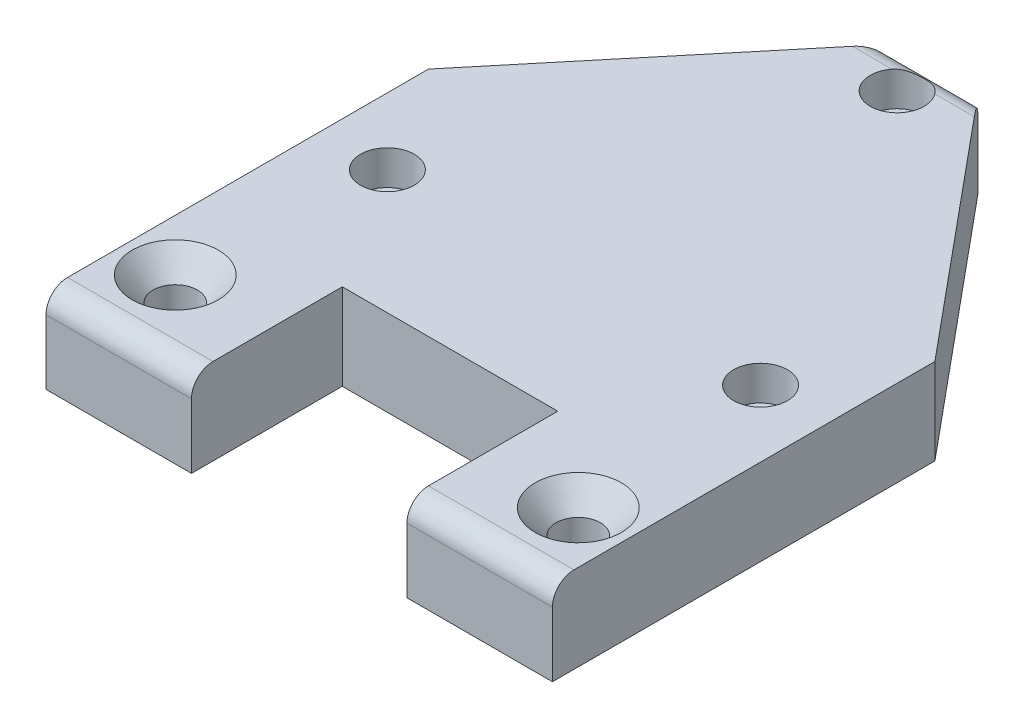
ISO-10303-21;
HEADER;
FILE_DESCRIPTION(('STEP AP214'),'2;1');
FILE_NAME('part.step','',(''),(''),'','','');
FILE_SCHEMA(('AUTOMOTIVE_DESIGN { 1 0 10303 214 1 1 1 1 }'));
ENDSEC;
DATA;
#1=APPLICATION_CONTEXT('core data for automotive mechanical design processes');
#2=APPLICATION_PROTOCOL_DEFINITION('international standard','automotive_design',2000,#1);
#3=PRODUCT_CONTEXT('',#1,'mechanical');
#4=PRODUCT('Part','Part','',(#3));
#5=PRODUCT_RELATED_PRODUCT_CATEGORY('part','',(#4));
#6=PRODUCT_DEFINITION_FORMATION('','',#4);
#7=PRODUCT_DEFINITION_CONTEXT('part definition',#1,'design');
#8=PRODUCT_DEFINITION('design','',#6,#7);
#9=PRODUCT_DEFINITION_SHAPE('','',#8);
#10=(LENGTH_UNIT() NAMED_UNIT(*) SI_UNIT(.MILLI.,.METRE.));
#11=(NAMED_UNIT(*) PLANE_ANGLE_UNIT() SI_UNIT($,.RADIAN.));
#12=(NAMED_UNIT(*) SI_UNIT($,.STERADIAN.) SOLID_ANGLE_UNIT());
#13=UNCERTAINTY_MEASURE_WITH_UNIT(LENGTH_MEASURE(1.E-05),#10,'distance_accuracy_value','');
#14=(GEOMETRIC_REPRESENTATION_CONTEXT(3) GLOBAL_UNCERTAINTY_ASSIGNED_CONTEXT((#13)) GLOBAL_UNIT_ASSIGNED_CONTEXT((#10,
#11,#12)) REPRESENTATION_CONTEXT('',''));
#15=CARTESIAN_POINT('',(0.,0.,0.));
#16=DIRECTION('',(0.,0.,1.));
#17=DIRECTION('',(1.,0.,0.));
#18=AXIS2_PLACEMENT_3D('',#15,#16,#17);
#19=CARTESIAN_POINT('',(27.4963065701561,12.7,15.8749999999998));
#20=DIRECTION('',(0.,-1.,0.));
#21=DIRECTION('',(0.,0.,-1.));
#22=AXIS2_PLACEMENT_3D('',#19,#20,#21);
#23=CYLINDRICAL_SURFACE('',#22,2.4892);
#24=CARTESIAN_POINT('',(27.4963065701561,0.,15.8749999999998));
#25=DIRECTION('',(0.,1.,0.));
#26=DIRECTION('',(0.,0.,1.));
#27=AXIS2_PLACEMENT_3D('',#24,#25,#26);
#28=CIRCLE('',#27,2.4892);
#29=CARTESIAN_POINT('',(27.4963065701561,0.,13.3857999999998));
#30=VERTEX_POINT('',#29);
#31=EDGE_CURVE('E371',#30,#30,#28,.T.);
#32=CARTESIAN_POINT('',(27.4963065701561,7.62,15.8749999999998));
#33=DIRECTION('',(0.,1.,0.));
#34=DIRECTION('',(0.,0.,1.));
#35=AXIS2_PLACEMENT_3D('',#32,#33,#34);
#36=CIRCLE('',#35,2.4892);
#37=CARTESIAN_POINT('',(27.4963065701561,7.62,13.3857999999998));
#38=VERTEX_POINT('',#37);
#39=EDGE_CURVE('E39',#38,#38,#36,.T.);
#40=CARTESIAN_POINT('',(27.4963065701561,0.,13.3857999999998));
#41=CARTESIAN_POINT('',(27.4963065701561,0.0793750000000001,13.3857999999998));
#42=CARTESIAN_POINT('',(27.4963065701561,0.15875,13.3857999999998));
#43=CARTESIAN_POINT('',(27.4963065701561,0.317500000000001,13.3857999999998));
#44=CARTESIAN_POINT('',(27.4963065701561,0.396875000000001,13.3857999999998));
#45=CARTESIAN_POINT('',(27.4963065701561,0.555625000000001,13.3857999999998));
#46=CARTESIAN_POINT('',(27.4963065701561,0.635,13.3857999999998));
#47=CARTESIAN_POINT('',(27.4963065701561,0.79375,13.3857999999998));
#48=CARTESIAN_POINT('',(27.4963065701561,0.873125,13.3857999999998));
#49=CARTESIAN_POINT('',(27.4963065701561,1.031875,13.3857999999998));
#50=CARTESIAN_POINT('',(27.4963065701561,1.11125,13.3857999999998));
#51=CARTESIAN_POINT('',(27.4963065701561,1.27,13.3857999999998));
#52=CARTESIAN_POINT('',(27.4963065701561,1.349375,13.3857999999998));
#53=CARTESIAN_POINT('',(27.4963065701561,1.508125,13.3857999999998));
#54=CARTESIAN_POINT('',(27.4963065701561,1.5875,13.3857999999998));
#55=CARTESIAN_POINT('',(27.4963065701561,1.74625,13.3857999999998));
#56=CARTESIAN_POINT('',(27.4963065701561,1.825625,13.3857999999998));
#57=CARTESIAN_POINT('',(27.4963065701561,1.984375,13.3857999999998));
#58=CARTESIAN_POINT('',(27.4963065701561,2.06375,13.3857999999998));
#59=CARTESIAN_POINT('',(27.4963065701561,2.2225,13.3857999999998));
#60=CARTESIAN_POINT('',(27.4963065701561,2.301875,13.3857999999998));
#61=CARTESIAN_POINT('',(27.4963065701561,2.460625,13.3857999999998));
#62=CARTESIAN_POINT('',(27.4963065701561,2.54,13.3857999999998));
#63=CARTESIAN_POINT('',(27.4963065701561,2.69875,13.3857999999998));
#64=CARTESIAN_POINT('',(27.4963065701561,2.778125,13.3857999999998));
#65=CARTESIAN_POINT('',(27.4963065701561,2.936875,13.3857999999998));
#66=CARTESIAN_POINT('',(27.4963065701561,3.01625,13.3857999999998));
#67=CARTESIAN_POINT('',(27.4963065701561,3.175,13.3857999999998));
#68=CARTESIAN_POINT('',(27.4963065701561,3.254375,13.3857999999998));
#69=CARTESIAN_POINT('',(27.4963065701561,3.413125,13.3857999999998));
#70=CARTESIAN_POINT('',(27.4963065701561,3.4925,13.3857999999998));
#71=CARTESIAN_POINT('',(27.4963065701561,3.65125,13.3857999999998));
#72=CARTESIAN_POINT('',(27.4963065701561,3.730625,13.3857999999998));
#73=CARTESIAN_POINT('',(27.4963065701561,3.889375,13.3857999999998));
#74=CARTESIAN_POINT('',(27.4963065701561,3.96875,13.3857999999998));
#75=CARTESIAN_POINT('',(27.4963065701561,4.1275,13.3857999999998));
#76=CARTESIAN_POINT('',(27.4963065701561,4.206875,13.3857999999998));
#77=CARTESIAN_POINT('',(27.4963065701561,4.365625,13.3857999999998));
#78=CARTESIAN_POINT('',(27.4963065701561,4.445,13.3857999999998));
#79=CARTESIAN_POINT('',(27.4963065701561,4.60375,13.3857999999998));
#80=CARTESIAN_POINT('',(27.4963065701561,4.683125,13.3857999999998));
#81=CARTESIAN_POINT('',(27.4963065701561,4.841875,13.3857999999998));
#82=CARTESIAN_POINT('',(27.4963065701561,4.92125,13.3857999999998));
#83=CARTESIAN_POINT('',(27.4963065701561,5.08,13.3857999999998));
#84=CARTESIAN_POINT('',(27.4963065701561,5.159375,13.3857999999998));
#85=CARTESIAN_POINT('',(27.4963065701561,5.318125,13.3857999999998));
#86=CARTESIAN_POINT('',(27.4963065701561,5.3975,13.3857999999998));
#87=CARTESIAN_POINT('',(27.4963065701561,5.55625,13.3857999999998));
#88=CARTESIAN_POINT('',(27.4963065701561,5.635625,13.3857999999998));
#89=CARTESIAN_POINT('',(27.4963065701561,5.794375,13.3857999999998));
#90=CARTESIAN_POINT('',(27.4963065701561,5.87375,13.3857999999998));
#91=CARTESIAN_POINT('',(27.4963065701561,6.0325,13.3857999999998));
#92=CARTESIAN_POINT('',(27.4963065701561,6.111875,13.3857999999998));
#93=CARTESIAN_POINT('',(27.4963065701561,6.270625,13.3857999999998));
#94=CARTESIAN_POINT('',(27.4963065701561,6.35,13.3857999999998));
#95=CARTESIAN_POINT('',(27.4963065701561,6.50875,13.3857999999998));
#96=CARTESIAN_POINT('',(27.4963065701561,6.588125,13.3857999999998));
#97=CARTESIAN_POINT('',(27.4963065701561,6.746875,13.3857999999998));
#98=CARTESIAN_POINT('',(27.4963065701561,6.82625,13.3857999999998));
#99=CARTESIAN_POINT('',(27.4963065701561,6.985,13.3857999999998));
#100=CARTESIAN_POINT('',(27.4963065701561,7.064375,13.3857999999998));
#101=CARTESIAN_POINT('',(27.4963065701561,7.223125,13.3857999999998));
#102=CARTESIAN_POINT('',(27.4963065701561,7.3025,13.3857999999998));
#103=CARTESIAN_POINT('',(27.4963065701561,7.46125,13.3857999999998));
#104=CARTESIAN_POINT('',(27.4963065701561,7.540625,13.3857999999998));
#105=CARTESIAN_POINT('',(27.4963065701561,7.62,13.3857999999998));
#106=B_SPLINE_CURVE_WITH_KNOTS('',3,(#40,#41,#42,#43,#44,#45,#46,#47,#48,#49,#50,#51,#52,#53,
#54,#55,#56,#57,#58,#59,#60,#61,#62,#63,#64,#65,#66,#67,#68,#69,#70,#71,#72,#73,#74,#75,#76,#77,
#78,#79,#80,#81,#82,#83,#84,#85,#86,#87,#88,#89,#90,#91,#92,#93,#94,#95,#96,#97,#98,#99,#100,
#101,#102,#103,#104,#105),.UNSPECIFIED.,.F.,.F.,(4,2,2,2,2,2,2,2,2,2,2,2,2,2,2,2,2,2,2,2,2,2,2,
2,2,2,2,2,2,2,2,2,4),(0.,0.238125,0.476250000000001,0.714375,0.9525,1.190625,1.42875,1.666875,
1.905,2.143125,2.38125,2.619375,2.8575,3.095625,3.33375,3.571875,3.81,4.048125,4.28625,4.524375,
4.7625,5.000625,5.23875,5.476875,5.715,5.953125,6.19125,6.429375,6.6675,6.905625,7.14375,
7.381875,7.62),.UNSPECIFIED.);
#107=EDGE_CURVE('BSEAM34',#30,#38,#106,.T.);
#108=ORIENTED_EDGE('',*,*,#31,.F.);
#109=ORIENTED_EDGE('',*,*,#39,.T.);
#110=ORIENTED_EDGE('',*,*,#107,.T.);
#111=ORIENTED_EDGE('',*,*,#107,.F.);
#112=EDGE_LOOP('',(#108,#110,#109,#111));
#113=FACE_BOUND('',#112,.T.);
#114=ADVANCED_FACE('F34',(#113),#23,.F.);
#115=CARTESIAN_POINT('',(-27.4963065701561,12.7,15.8749999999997));
#116=DIRECTION('',(0.,-1.,0.));
#117=DIRECTION('',(0.,0.,-1.));
#118=AXIS2_PLACEMENT_3D('',#115,#116,#117);
#119=CYLINDRICAL_SURFACE('',#118,2.4892);
#120=CARTESIAN_POINT('',(-27.4963065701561,0.,15.8749999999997));
#121=DIRECTION('',(0.,1.,0.));
#122=DIRECTION('',(0.,0.,1.));
#123=AXIS2_PLACEMENT_3D('',#120,#121,#122);
#124=CIRCLE('',#123,2.4892);
#125=CARTESIAN_POINT('',(-27.4963065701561,0.,13.3857999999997));
#126=VERTEX_POINT('',#125);
#127=EDGE_CURVE('E374',#126,#126,#124,.T.);
#128=CARTESIAN_POINT('',(-27.4963065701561,7.62,15.8749999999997));
#129=DIRECTION('',(0.,1.,0.));
#130=DIRECTION('',(0.,0.,1.));
#131=AXIS2_PLACEMENT_3D('',#128,#129,#130);
#132=CIRCLE('',#131,2.4892);
#133=CARTESIAN_POINT('',(-27.4963065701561,7.62,13.3857999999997));
#134=VERTEX_POINT('',#133);
#135=EDGE_CURVE('E148',#134,#134,#132,.T.);
#136=CARTESIAN_POINT('',(-27.4963065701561,0.,13.3857999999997));
#137=CARTESIAN_POINT('',(-27.4963065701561,0.0793750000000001,13.3857999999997));
#138=CARTESIAN_POINT('',(-27.4963065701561,0.15875,13.3857999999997));
#139=CARTESIAN_POINT('',(-27.4963065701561,0.317500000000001,13.3857999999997));
#140=CARTESIAN_POINT('',(-27.4963065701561,0.396875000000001,13.3857999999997));
#141=CARTESIAN_POINT('',(-27.4963065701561,0.555625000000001,13.3857999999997));
#142=CARTESIAN_POINT('',(-27.4963065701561,0.635,13.3857999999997));
#143=CARTESIAN_POINT('',(-27.4963065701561,0.79375,13.3857999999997));
#144=CARTESIAN_POINT('',(-27.4963065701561,0.873125,13.3857999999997));
#145=CARTESIAN_POINT('',(-27.4963065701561,1.031875,13.3857999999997));
#146=CARTESIAN_POINT('',(-27.4963065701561,1.11125,13.3857999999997));
#147=CARTESIAN_POINT('',(-27.4963065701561,1.27,13.3857999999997));
#148=CARTESIAN_POINT('',(-27.4963065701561,1.349375,13.3857999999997));
#149=CARTESIAN_POINT('',(-27.4963065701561,1.508125,13.3857999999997));
#150=CARTESIAN_POINT('',(-27.4963065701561,1.5875,13.3857999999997));
#151=CARTESIAN_POINT('',(-27.4963065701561,1.74625,13.3857999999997));
#152=CARTESIAN_POINT('',(-27.4963065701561,1.825625,13.3857999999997));
#153=CARTESIAN_POINT('',(-27.4963065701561,1.984375,13.3857999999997));
#154=CARTESIAN_POINT('',(-27.4963065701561,2.06375,13.3857999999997));
#155=CARTESIAN_POINT('',(-27.4963065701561,2.2225,13.3857999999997));
#156=CARTESIAN_POINT('',(-27.4963065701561,2.301875,13.3857999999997));
#157=CARTESIAN_POINT('',(-27.4963065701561,2.460625,13.3857999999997));
#158=CARTESIAN_POINT('',(-27.4963065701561,2.54,13.3857999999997));
#159=CARTESIAN_POINT('',(-27.4963065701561,2.69875,13.3857999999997));
#160=CARTESIAN_POINT('',(-27.4963065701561,2.778125,13.3857999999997));
#161=CARTESIAN_POINT('',(-27.4963065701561,2.936875,13.3857999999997));
#162=CARTESIAN_POINT('',(-27.4963065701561,3.01625,13.3857999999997));
#163=CARTESIAN_POINT('',(-27.4963065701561,3.175,13.3857999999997));
#164=CARTESIAN_POINT('',(-27.4963065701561,3.254375,13.3857999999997));
#165=CARTESIAN_POINT('',(-27.4963065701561,3.413125,13.3857999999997));
#166=CARTESIAN_POINT('',(-27.4963065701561,3.4925,13.3857999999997));
#167=CARTESIAN_POINT('',(-27.4963065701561,3.65125,13.3857999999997));
#168=CARTESIAN_POINT('',(-27.4963065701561,3.730625,13.3857999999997));
#169=CARTESIAN_POINT('',(-27.4963065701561,3.889375,13.3857999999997));
#170=CARTESIAN_POINT('',(-27.4963065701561,3.96875,13.3857999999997));
#171=CARTESIAN_POINT('',(-27.4963065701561,4.1275,13.3857999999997));
#172=CARTESIAN_POINT('',(-27.4963065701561,4.206875,13.3857999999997));
#173=CARTESIAN_POINT('',(-27.4963065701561,4.365625,13.3857999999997));
#174=CARTESIAN_POINT('',(-27.4963065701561,4.445,13.3857999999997));
#175=CARTESIAN_POINT('',(-27.4963065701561,4.60375,13.3857999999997));
#176=CARTESIAN_POINT('',(-27.4963065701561,4.683125,13.3857999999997));
#177=CARTESIAN_POINT('',(-27.4963065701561,4.841875,13.3857999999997));
#178=CARTESIAN_POINT('',(-27.4963065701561,4.92125,13.3857999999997));
#179=CARTESIAN_POINT('',(-27.4963065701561,5.08,13.3857999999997));
#180=CARTESIAN_POINT('',(-27.4963065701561,5.159375,13.3857999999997));
#181=CARTESIAN_POINT('',(-27.4963065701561,5.318125,13.3857999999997));
#182=CARTESIAN_POINT('',(-27.4963065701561,5.3975,13.3857999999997));
#183=CARTESIAN_POINT('',(-27.4963065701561,5.55625,13.3857999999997));
#184=CARTESIAN_POINT('',(-27.4963065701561,5.635625,13.3857999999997));
#185=CARTESIAN_POINT('',(-27.4963065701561,5.794375,13.3857999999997));
#186=CARTESIAN_POINT('',(-27.4963065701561,5.87375,13.3857999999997));
#187=CARTESIAN_POINT('',(-27.4963065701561,6.0325,13.3857999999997));
#188=CARTESIAN_POINT('',(-27.4963065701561,6.111875,13.3857999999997));
#189=CARTESIAN_POINT('',(-27.4963065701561,6.270625,13.3857999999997));
#190=CARTESIAN_POINT('',(-27.4963065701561,6.35,13.3857999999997));
#191=CARTESIAN_POINT('',(-27.4963065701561,6.50875,13.3857999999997));
#192=CARTESIAN_POINT('',(-27.4963065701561,6.588125,13.3857999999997));
#193=CARTESIAN_POINT('',(-27.4963065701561,6.746875,13.3857999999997));
#194=CARTESIAN_POINT('',(-27.4963065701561,6.82625,13.3857999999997));
#195=CARTESIAN_POINT('',(-27.4963065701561,6.985,13.3857999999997));
#196=CARTESIAN_POINT('',(-27.4963065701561,7.064375,13.3857999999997));
#197=CARTESIAN_POINT('',(-27.4963065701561,7.223125,13.3857999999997));
#198=CARTESIAN_POINT('',(-27.4963065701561,7.3025,13.3857999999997));
#199=CARTESIAN_POINT('',(-27.4963065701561,7.46125,13.3857999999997));
#200=CARTESIAN_POINT('',(-27.4963065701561,7.540625,13.3857999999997));
#201=CARTESIAN_POINT('',(-27.4963065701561,7.62,13.3857999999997));
#202=B_SPLINE_CURVE_WITH_KNOTS('',3,(#136,#137,#138,#139,#140,#141,#142,#143,#144,#145,#146,
#147,#148,#149,#150,#151,#152,#153,#154,#155,#156,#157,#158,#159,#160,#161,#162,#163,#164,#165,
#166,#167,#168,#169,#170,#171,#172,#173,#174,#175,#176,#177,#178,#179,#180,#181,#182,#183,#184,
#185,#186,#187,#188,#189,#190,#191,#192,#193,#194,#195,#196,#197,#198,#199,#200,#201),
.UNSPECIFIED.,.F.,.F.,(4,2,2,2,2,2,2,2,2,2,2,2,2,2,2,2,2,2,2,2,2,2,2,2,2,2,2,2,2,2,2,2,4),(0.,
0.238125,0.476250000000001,0.714375,0.9525,1.190625,1.42875,1.666875,1.905,2.143125,2.38125,
2.619375,2.8575,3.095625,3.33375,3.571875,3.81,4.048125,4.28625,4.524375,4.7625,5.000625,
5.23875,5.476875,5.715,5.953125,6.19125,6.429375,6.6675,6.905625,7.14375,7.381875,7.62),.UNSPECIFIED.);
#203=EDGE_CURVE('BSEAM210',#126,#134,#202,.T.);
#204=ORIENTED_EDGE('',*,*,#127,.F.);
#205=ORIENTED_EDGE('',*,*,#135,.T.);
#206=ORIENTED_EDGE('',*,*,#203,.T.);
#207=ORIENTED_EDGE('',*,*,#203,.F.);
#208=EDGE_LOOP('',(#204,#206,#205,#207));
#209=FACE_BOUND('',#208,.T.);
#210=ADVANCED_FACE('F210',(#209),#119,.F.);
#211=CARTESIAN_POINT('',(0.,12.7,-31.75));
#212=DIRECTION('',(0.,-1.,0.));
#213=DIRECTION('',(0.,0.,-1.));
#214=AXIS2_PLACEMENT_3D('',#211,#212,#213);
#215=CYLINDRICAL_SURFACE('',#214,2.4892);
#216=CARTESIAN_POINT('',(0.,0.,-31.75));
#217=DIRECTION('',(0.,1.,0.));
#218=DIRECTION('',(0.,0.,1.));
#219=AXIS2_PLACEMENT_3D('',#216,#217,#218);
#220=CIRCLE('',#219,2.4892);
#221=CARTESIAN_POINT('',(0.,0.,-34.2392));
#222=VERTEX_POINT('',#221);
#223=EDGE_CURVE('E304',#222,#222,#220,.T.);
#224=CARTESIAN_POINT('',(0.,7.62,-31.75));
#225=DIRECTION('',(0.,1.,0.));
#226=DIRECTION('',(0.,0.,1.));
#227=AXIS2_PLACEMENT_3D('',#224,#225,#226);
#228=CIRCLE('',#227,2.4892);
#229=CARTESIAN_POINT('',(0.,7.62,-34.2392));
#230=VERTEX_POINT('',#229);
#231=EDGE_CURVE('E185',#230,#230,#228,.T.);
#232=CARTESIAN_POINT('',(0.,0.,-34.2392));
#233=CARTESIAN_POINT('',(0.,0.0793750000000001,-34.2392));
#234=CARTESIAN_POINT('',(0.,0.15875,-34.2392));
#235=CARTESIAN_POINT('',(0.,0.317500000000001,-34.2392));
#236=CARTESIAN_POINT('',(0.,0.396875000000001,-34.2392));
#237=CARTESIAN_POINT('',(0.,0.555625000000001,-34.2392));
#238=CARTESIAN_POINT('',(0.,0.635,-34.2392));
#239=CARTESIAN_POINT('',(0.,0.79375,-34.2392));
#240=CARTESIAN_POINT('',(0.,0.873125,-34.2392));
#241=CARTESIAN_POINT('',(0.,1.031875,-34.2392));
#242=CARTESIAN_POINT('',(0.,1.11125,-34.2392));
#243=CARTESIAN_POINT('',(0.,1.27,-34.2392));
#244=CARTESIAN_POINT('',(0.,1.349375,-34.2392));
#245=CARTESIAN_POINT('',(0.,1.508125,-34.2392));
#246=CARTESIAN_POINT('',(0.,1.5875,-34.2392));
#247=CARTESIAN_POINT('',(0.,1.74625,-34.2392));
#248=CARTESIAN_POINT('',(0.,1.825625,-34.2392));
#249=CARTESIAN_POINT('',(0.,1.984375,-34.2392));
#250=CARTESIAN_POINT('',(0.,2.06375,-34.2392));
#251=CARTESIAN_POINT('',(0.,2.2225,-34.2392));
#252=CARTESIAN_POINT('',(0.,2.301875,-34.2392));
#253=CARTESIAN_POINT('',(0.,2.460625,-34.2392));
#254=CARTESIAN_POINT('',(0.,2.54,-34.2392));
#255=CARTESIAN_POINT('',(0.,2.69875,-34.2392));
#256=CARTESIAN_POINT('',(0.,2.778125,-34.2392));
#257=CARTESIAN_POINT('',(0.,2.936875,-34.2392));
#258=CARTESIAN_POINT('',(0.,3.01625,-34.2392));
#259=CARTESIAN_POINT('',(0.,3.175,-34.2392));
#260=CARTESIAN_POINT('',(0.,3.254375,-34.2392));
#261=CARTESIAN_POINT('',(0.,3.413125,-34.2392));
#262=CARTESIAN_POINT('',(0.,3.4925,-34.2392));
#263=CARTESIAN_POINT('',(0.,3.65125,-34.2392));
#264=CARTESIAN_POINT('',(0.,3.730625,-34.2392));
#265=CARTESIAN_POINT('',(0.,3.889375,-34.2392));
#266=CARTESIAN_POINT('',(0.,3.96875,-34.2392));
#267=CARTESIAN_POINT('',(0.,4.1275,-34.2392));
#268=CARTESIAN_POINT('',(0.,4.206875,-34.2392));
#269=CARTESIAN_POINT('',(0.,4.365625,-34.2392));
#270=CARTESIAN_POINT('',(0.,4.445,-34.2392));
#271=CARTESIAN_POINT('',(0.,4.60375,-34.2392));
#272=CARTESIAN_POINT('',(0.,4.683125,-34.2392));
#273=CARTESIAN_POINT('',(0.,4.841875,-34.2392));
#274=CARTESIAN_POINT('',(0.,4.92125,-34.2392));
#275=CARTESIAN_POINT('',(0.,5.08,-34.2392));
#276=CARTESIAN_POINT('',(0.,5.159375,-34.2392));
#277=CARTESIAN_POINT('',(0.,5.318125,-34.2392));
#278=CARTESIAN_POINT('',(0.,5.3975,-34.2392));
#279=CARTESIAN_POINT('',(0.,5.55625,-34.2392));
#280=CARTESIAN_POINT('',(0.,5.635625,-34.2392));
#281=CARTESIAN_POINT('',(0.,5.794375,-34.2392));
#282=CARTESIAN_POINT('',(0.,5.87375,-34.2392));
#283=CARTESIAN_POINT('',(0.,6.0325,-34.2392));
#284=CARTESIAN_POINT('',(0.,6.111875,-34.2392));
#285=CARTESIAN_POINT('',(0.,6.270625,-34.2392));
#286=CARTESIAN_POINT('',(0.,6.35,-34.2392));
#287=CARTESIAN_POINT('',(0.,6.50875,-34.2392));
#288=CARTESIAN_POINT('',(0.,6.588125,-34.2392));
#289=CARTESIAN_POINT('',(0.,6.746875,-34.2392));
#290=CARTESIAN_POINT('',(0.,6.82625,-34.2392));
#291=CARTESIAN_POINT('',(0.,6.985,-34.2392));
#292=CARTESIAN_POINT('',(0.,7.064375,-34.2392));
#293=CARTESIAN_POINT('',(0.,7.223125,-34.2392));
#294=CARTESIAN_POINT('',(0.,7.3025,-34.2392));
#295=CARTESIAN_POINT('',(0.,7.46125,-34.2392));
#296=CARTESIAN_POINT('',(0.,7.540625,-34.2392));
#297=CARTESIAN_POINT('',(0.,7.62,-34.2392));
#298=B_SPLINE_CURVE_WITH_KNOTS('',3,(#232,#233,#234,#235,#236,#237,#238,#239,#240,#241,#242,
#243,#244,#245,#246,#247,#248,#249,#250,#251,#252,#253,#254,#255,#256,#257,#258,#259,#260,#261,
#262,#263,#264,#265,#266,#267,#268,#269,#270,#271,#272,#273,#274,#275,#276,#277,#278,#279,#280,
#281,#282,#283,#284,#285,#286,#287,#288,#289,#290,#291,#292,#293,#294,#295,#296,#297),
.UNSPECIFIED.,.F.,.F.,(4,2,2,2,2,2,2,2,2,2,2,2,2,2,2,2,2,2,2,2,2,2,2,2,2,2,2,2,2,2,2,2,4),(0.,
0.238125,0.476250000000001,0.714375,0.9525,1.190625,1.42875,1.666875,1.905,2.143125,2.38125,
2.619375,2.8575,3.095625,3.33375,3.571875,3.81,4.048125,4.28625,4.524375,4.7625,5.000625,
5.23875,5.476875,5.715,5.953125,6.19125,6.429375,6.6675,6.905625,7.14375,7.381875,7.62),.UNSPECIFIED.);
#299=EDGE_CURVE('BSEAM213',#222,#230,#298,.T.);
#300=ORIENTED_EDGE('',*,*,#223,.F.);
#301=ORIENTED_EDGE('',*,*,#231,.T.);
#302=ORIENTED_EDGE('',*,*,#299,.T.);
#303=ORIENTED_EDGE('',*,*,#299,.F.);
#304=EDGE_LOOP('',(#300,#302,#301,#303));
#305=FACE_BOUND('',#304,.T.);
#306=ADVANCED_FACE('F213',(#305),#215,.F.);
#307=CARTESIAN_POINT('',(37.3126,12.7,56.3626));
#308=DIRECTION('',(0.,-1.,0.));
#309=DIRECTION('',(0.,0.,-1.));
#310=AXIS2_PLACEMENT_3D('',#307,#308,#309);
#311=PLANE('',#310);
#312=CARTESIAN_POINT('',(27.4963065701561,12.7,15.8749999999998));
#313=DIRECTION('',(0.,1.,0.));
#314=DIRECTION('',(0.,0.,1.));
#315=AXIS2_PLACEMENT_3D('',#312,#313,#314);
#316=CIRCLE('',#315,3.9624);
#317=CARTESIAN_POINT('',(27.4963065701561,12.7,19.8373999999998));
#318=VERTEX_POINT('',#317);
#319=EDGE_CURVE('E403',#318,#318,#316,.T.);
#320=ORIENTED_EDGE('',*,*,#319,.F.);
#321=EDGE_LOOP('',(#320));
#322=FACE_BOUND('',#321,.T.);
#323=CARTESIAN_POINT('',(-27.4963065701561,12.7,15.8749999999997));
#324=DIRECTION('',(0.,1.,0.));
#325=DIRECTION('',(0.,0.,1.));
#326=AXIS2_PLACEMENT_3D('',#323,#324,#325);
#327=CIRCLE('',#326,3.9624);
#328=CARTESIAN_POINT('',(-27.4963065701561,12.7,19.8373999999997));
#329=VERTEX_POINT('',#328);
#330=EDGE_CURVE('E397',#329,#329,#327,.T.);
#331=ORIENTED_EDGE('',*,*,#330,.F.);
#332=EDGE_LOOP('',(#331));
#333=FACE_BOUND('',#332,.T.);
#334=CARTESIAN_POINT('',(-29.6926,12.7,44.9326));
#335=DIRECTION('',(0.,1.,0.));
#336=DIRECTION('',(0.,0.,1.));
#337=AXIS2_PLACEMENT_3D('',#334,#335,#336);
#338=CIRCLE('',#337,6.35);
#339=CARTESIAN_POINT('',(-29.6926,12.7,51.2826));
#340=VERTEX_POINT('',#339);
#341=EDGE_CURVE('E392',#340,#340,#338,.T.);
#342=ORIENTED_EDGE('',*,*,#341,.F.);
#343=EDGE_LOOP('',(#342));
#344=FACE_BOUND('',#343,.T.);
#345=CARTESIAN_POINT('',(29.6926,12.7,44.9326));
#346=DIRECTION('',(0.,1.,0.));
#347=DIRECTION('',(0.,0.,1.));
#348=AXIS2_PLACEMENT_3D('',#345,#346,#347);
#349=CIRCLE('',#348,6.35);
#350=CARTESIAN_POINT('',(29.6926,12.7,51.2826));
#351=VERTEX_POINT('',#350);
#352=EDGE_CURVE('E383',#351,#351,#349,.T.);
#353=ORIENTED_EDGE('',*,*,#352,.F.);
#354=EDGE_LOOP('',(#353));
#355=FACE_BOUND('',#354,.T.);
#356=DIRECTION('',(-1.,0.,0.));
#357=VECTOR('',#356,1.);
#358=CARTESIAN_POINT('',(37.3126,12.7,-34.1376));
#359=LINE('',#358,#357);
#360=CARTESIAN_POINT('',(8.98466643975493,12.7,-34.1376));
#361=VERTEX_POINT('',#360);
#362=CARTESIAN_POINT('',(3.16227449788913,12.7,-34.1376));
#363=VERTEX_POINT('',#362);
#364=EDGE_CURVE('E146',#361,#363,#359,.T.);
#365=ORIENTED_EDGE('',*,*,#364,.T.);
#366=CARTESIAN_POINT('',(0.,12.7,-31.75));
#367=DIRECTION('',(0.,1.,0.));
#368=DIRECTION('',(0.,0.,1.));
#369=AXIS2_PLACEMENT_3D('',#366,#367,#368);
#370=CIRCLE('',#369,3.9624);
#371=CARTESIAN_POINT('',(-3.16227449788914,12.7,-34.1376));
#372=VERTEX_POINT('',#371);
#373=EDGE_CURVE('E50',#372,#363,#370,.T.);
#374=ORIENTED_EDGE('',*,*,#373,.F.);
#375=DIRECTION('',(-1.,0.,0.));
#376=VECTOR('',#375,1.);
#377=CARTESIAN_POINT('',(37.3126,12.7,-34.1376));
#378=LINE('',#377,#376);
#379=CARTESIAN_POINT('',(-8.98466643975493,12.7,-34.1376));
#380=VERTEX_POINT('',#379);
#381=EDGE_CURVE('E143',#372,#380,#378,.T.);
#382=ORIENTED_EDGE('',*,*,#381,.T.);
#383=DIRECTION('',(-0.638585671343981,0.,0.769550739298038));
#384=VECTOR('',#383,1.);
#385=CARTESIAN_POINT('',(-6.35,12.7,-37.3126));
#386=LINE('',#385,#384);
#387=CARTESIAN_POINT('',(-37.3126,12.7,0.));
#388=VERTEX_POINT('',#387);
#389=EDGE_CURVE('E285',#380,#388,#386,.T.);
#390=ORIENTED_EDGE('',*,*,#389,.T.);
#391=DIRECTION('',(0.,0.,1.));
#392=VECTOR('',#391,1.);
#393=CARTESIAN_POINT('',(-37.3126,12.7,0.));
#394=LINE('',#393,#392);
#395=CARTESIAN_POINT('',(-37.3126,12.7,53.1876));
#396=VERTEX_POINT('',#395);
#397=EDGE_CURVE('E281',#388,#396,#394,.T.);
#398=ORIENTED_EDGE('',*,*,#397,.T.);
#399=DIRECTION('',(1.,0.,0.));
#400=VECTOR('',#399,1.);
#401=CARTESIAN_POINT('',(37.3126,12.7,53.1876));
#402=LINE('',#401,#400);
#403=CARTESIAN_POINT('',(-15.875,12.7,53.1876));
#404=VERTEX_POINT('',#403);
#405=EDGE_CURVE('E154',#396,#404,#402,.T.);
#406=ORIENTED_EDGE('',*,*,#405,.T.);
#407=DIRECTION('',(0.,0.,-1.));
#408=VECTOR('',#407,1.);
#409=CARTESIAN_POINT('',(-15.875,12.7,56.3626));
#410=LINE('',#409,#408);
#411=CARTESIAN_POINT('',(-15.875,12.7,34.1376));
#412=VERTEX_POINT('',#411);
#413=EDGE_CURVE('E287',#404,#412,#410,.T.);
#414=ORIENTED_EDGE('',*,*,#413,.T.);
#415=DIRECTION('',(1.,0.,0.));
#416=VECTOR('',#415,1.);
#417=CARTESIAN_POINT('',(-15.875,12.7,34.1376));
#418=LINE('',#417,#416);
#419=CARTESIAN_POINT('',(15.875,12.7,34.1376));
#420=VERTEX_POINT('',#419);
#421=EDGE_CURVE('E289',#412,#420,#418,.T.);
#422=ORIENTED_EDGE('',*,*,#421,.T.);
#423=DIRECTION('',(0.,0.,1.));
#424=VECTOR('',#423,1.);
#425=CARTESIAN_POINT('',(15.875,12.7,56.3626));
#426=LINE('',#425,#424);
#427=CARTESIAN_POINT('',(15.875,12.7,53.1876));
#428=VERTEX_POINT('',#427);
#429=EDGE_CURVE('E296',#420,#428,#426,.T.);
#430=ORIENTED_EDGE('',*,*,#429,.T.);
#431=DIRECTION('',(1.,0.,0.));
#432=VECTOR('',#431,1.);
#433=CARTESIAN_POINT('',(37.3126,12.7,53.1876));
#434=LINE('',#433,#432);
#435=CARTESIAN_POINT('',(37.3126,12.7,53.1876));
#436=VERTEX_POINT('',#435);
#437=EDGE_CURVE('E163',#428,#436,#434,.T.);
#438=ORIENTED_EDGE('',*,*,#437,.T.);
#439=DIRECTION('',(0.,0.,-1.));
#440=VECTOR('',#439,1.);
#441=CARTESIAN_POINT('',(37.3126,12.7,0.));
#442=LINE('',#441,#440);
#443=CARTESIAN_POINT('',(37.3126,12.7,0.));
#444=VERTEX_POINT('',#443);
#445=EDGE_CURVE('E327',#436,#444,#442,.T.);
#446=ORIENTED_EDGE('',*,*,#445,.T.);
#447=DIRECTION('',(-0.638585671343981,0.,-0.769550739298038));
#448=VECTOR('',#447,1.);
#449=CARTESIAN_POINT('',(6.35,12.7,-37.3126));
#450=LINE('',#449,#448);
#451=EDGE_CURVE('E291',#444,#361,#450,.T.);
#452=ORIENTED_EDGE('',*,*,#451,.T.);
#453=EDGE_LOOP('',(#365,#374,#382,#390,#398,#406,#414,#422,#430,#438,#446,#452));
#454=FACE_BOUND('',#453,.T.);
#455=ADVANCED_FACE('F142',(#322,#333,#344,#355,#454),#311,.F.);
#456=CARTESIAN_POINT('',(37.3126,0.,56.3626));
#457=DIRECTION('',(0.,-1.,0.));
#458=DIRECTION('',(0.,0.,-1.));
#459=AXIS2_PLACEMENT_3D('',#456,#457,#458);
#460=PLANE('',#459);
#461=CARTESIAN_POINT('',(-29.6926,0.,44.9326));
#462=DIRECTION('',(0.,1.,0.));
#463=DIRECTION('',(0.,0.,1.));
#464=AXIS2_PLACEMENT_3D('',#461,#462,#463);
#465=CIRCLE('',#464,3.26389999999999);
#466=CARTESIAN_POINT('',(-29.6926,0.,48.1965));
#467=VERTEX_POINT('',#466);
#468=EDGE_CURVE('E386',#467,#467,#465,.T.);
#469=ORIENTED_EDGE('',*,*,#468,.T.);
#470=EDGE_LOOP('',(#469));
#471=FACE_BOUND('',#470,.T.);
#472=CARTESIAN_POINT('',(29.6926,0.,44.9326));
#473=DIRECTION('',(0.,1.,0.));
#474=DIRECTION('',(0.,0.,1.));
#475=AXIS2_PLACEMENT_3D('',#472,#473,#474);
#476=CIRCLE('',#475,3.26389999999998);
#477=CARTESIAN_POINT('',(29.6926,0.,48.1965));
#478=VERTEX_POINT('',#477);
#479=EDGE_CURVE('E377',#478,#478,#476,.T.);
#480=ORIENTED_EDGE('',*,*,#479,.T.);
#481=EDGE_LOOP('',(#480));
#482=FACE_BOUND('',#481,.T.);
#483=ORIENTED_EDGE('',*,*,#31,.T.);
#484=EDGE_LOOP('',(#483));
#485=FACE_BOUND('',#484,.T.);
#486=DIRECTION('',(0.,0.,-1.));
#487=VECTOR('',#486,1.);
#488=CARTESIAN_POINT('',(37.3126,0.,0.));
#489=LINE('',#488,#487);
#490=CARTESIAN_POINT('',(37.3126,0.,56.3626));
#491=VERTEX_POINT('',#490);
#492=CARTESIAN_POINT('',(37.3126,0.,0.));
#493=VERTEX_POINT('',#492);
#494=EDGE_CURVE('E300',#491,#493,#489,.T.);
#495=ORIENTED_EDGE('',*,*,#494,.F.);
#496=DIRECTION('',(1.,0.,0.));
#497=VECTOR('',#496,1.);
#498=CARTESIAN_POINT('',(37.3126,0.,56.3626));
#499=LINE('',#498,#497);
#500=CARTESIAN_POINT('',(15.875,0.,56.3626));
#501=VERTEX_POINT('',#500);
#502=EDGE_CURVE('E324',#501,#491,#499,.T.);
#503=ORIENTED_EDGE('',*,*,#502,.F.);
#504=DIRECTION('',(0.,0.,1.));
#505=VECTOR('',#504,1.);
#506=CARTESIAN_POINT('',(15.875,0.,56.3626));
#507=LINE('',#506,#505);
#508=CARTESIAN_POINT('',(15.875,0.,34.1376));
#509=VERTEX_POINT('',#508);
#510=EDGE_CURVE('E321',#509,#501,#507,.T.);
#511=ORIENTED_EDGE('',*,*,#510,.F.);
#512=DIRECTION('',(1.,0.,0.));
#513=VECTOR('',#512,1.);
#514=CARTESIAN_POINT('',(-15.875,0.,34.1376));
#515=LINE('',#514,#513);
#516=CARTESIAN_POINT('',(-15.875,0.,34.1376));
#517=VERTEX_POINT('',#516);
#518=EDGE_CURVE('E319',#517,#509,#515,.T.);
#519=ORIENTED_EDGE('',*,*,#518,.F.);
#520=DIRECTION('',(0.,0.,-1.));
#521=VECTOR('',#520,1.);
#522=CARTESIAN_POINT('',(-15.875,0.,56.3626));
#523=LINE('',#522,#521);
#524=CARTESIAN_POINT('',(-15.875,0.,56.3626));
#525=VERTEX_POINT('',#524);
#526=EDGE_CURVE('E317',#525,#517,#523,.T.);
#527=ORIENTED_EDGE('',*,*,#526,.F.);
#528=DIRECTION('',(1.,0.,0.));
#529=VECTOR('',#528,1.);
#530=CARTESIAN_POINT('',(-37.3126,0.,56.3626));
#531=LINE('',#530,#529);
#532=CARTESIAN_POINT('',(-37.3126,0.,56.3626));
#533=VERTEX_POINT('',#532);
#534=EDGE_CURVE('E314',#533,#525,#531,.T.);
#535=ORIENTED_EDGE('',*,*,#534,.F.);
#536=DIRECTION('',(0.,0.,1.));
#537=VECTOR('',#536,1.);
#538=CARTESIAN_POINT('',(-37.3126,0.,0.));
#539=LINE('',#538,#537);
#540=CARTESIAN_POINT('',(-37.3126,0.,0.));
#541=VERTEX_POINT('',#540);
#542=EDGE_CURVE('E312',#541,#533,#539,.T.);
#543=ORIENTED_EDGE('',*,*,#542,.F.);
#544=DIRECTION('',(-0.638585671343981,0.,0.769550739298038));
#545=VECTOR('',#544,1.);
#546=CARTESIAN_POINT('',(-6.35,0.,-37.3126));
#547=LINE('',#546,#545);
#548=CARTESIAN_POINT('',(-6.35,0.,-37.3126));
#549=VERTEX_POINT('',#548);
#550=EDGE_CURVE('E310',#549,#541,#547,.T.);
#551=ORIENTED_EDGE('',*,*,#550,.F.);
#552=DIRECTION('',(-1.,0.,0.));
#553=VECTOR('',#552,1.);
#554=CARTESIAN_POINT('',(6.35,0.,-37.3126));
#555=LINE('',#554,#553);
#556=CARTESIAN_POINT('',(6.35,0.,-37.3126));
#557=VERTEX_POINT('',#556);
#558=EDGE_CURVE('E307',#557,#549,#555,.T.);
#559=ORIENTED_EDGE('',*,*,#558,.F.);
#560=DIRECTION('',(-0.638585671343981,0.,-0.769550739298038));
#561=VECTOR('',#560,1.);
#562=CARTESIAN_POINT('',(6.35,0.,-37.3126));
#563=LINE('',#562,#561);
#564=EDGE_CURVE('E303',#493,#557,#563,.T.);
#565=ORIENTED_EDGE('',*,*,#564,.F.);
#566=EDGE_LOOP('',(#495,#503,#511,#519,#527,#535,#543,#551,#559,#565));
#567=FACE_BOUND('',#566,.T.);
#568=ORIENTED_EDGE('',*,*,#223,.T.);
#569=EDGE_LOOP('',(#568));
#570=FACE_BOUND('',#569,.T.);
#571=ORIENTED_EDGE('',*,*,#127,.T.);
#572=EDGE_LOOP('',(#571));
#573=FACE_BOUND('',#572,.T.);
#574=ADVANCED_FACE('F223',(#471,#482,#485,#567,#570,#573),#460,.T.);
#575=CARTESIAN_POINT('',(37.3126,12.7,0.));
#576=DIRECTION('',(-1.,0.,0.));
#577=DIRECTION('',(0.,0.,1.));
#578=AXIS2_PLACEMENT_3D('',#575,#576,#577);
#579=PLANE('',#578);
#580=ORIENTED_EDGE('',*,*,#445,.F.);
#581=CARTESIAN_POINT('',(37.3126,9.525,53.1876));
#582=DIRECTION('',(-1.,0.,0.));
#583=DIRECTION('',(0.,0.,1.));
#584=AXIS2_PLACEMENT_3D('',#581,#582,#583);
#585=CIRCLE('',#584,3.175);
#586=CARTESIAN_POINT('',(37.3126,9.525,56.3626));
#587=VERTEX_POINT('',#586);
#588=EDGE_CURVE('E166',#436,#587,#585,.F.);
#589=ORIENTED_EDGE('',*,*,#588,.T.);
#590=DIRECTION('',(0.,-1.,0.));
#591=VECTOR('',#590,1.);
#592=CARTESIAN_POINT('',(37.3126,12.7,56.3626));
#593=LINE('',#592,#591);
#594=EDGE_CURVE('E299',#587,#491,#593,.T.);
#595=ORIENTED_EDGE('',*,*,#594,.T.);
#596=ORIENTED_EDGE('',*,*,#494,.T.);
#597=DIRECTION('',(0.,-1.,0.));
#598=VECTOR('',#597,1.);
#599=CARTESIAN_POINT('',(37.3126,12.7,0.));
#600=LINE('',#599,#598);
#601=EDGE_CURVE('E152',#444,#493,#600,.T.);
#602=ORIENTED_EDGE('',*,*,#601,.F.);
#603=EDGE_LOOP('',(#580,#589,#595,#596,#602));
#604=FACE_BOUND('',#603,.T.);
#605=ADVANCED_FACE('F227',(#604),#579,.F.);
#606=CARTESIAN_POINT('',(6.35,12.7,-37.3126));
#607=DIRECTION('',(-0.769550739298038,0.,0.638585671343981));
#608=DIRECTION('',(0.638585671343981,0.,0.769550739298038));
#609=AXIS2_PLACEMENT_3D('',#606,#607,#608);
#610=PLANE('',#609);
#611=DIRECTION('',(0.,-1.,0.));
#612=VECTOR('',#611,1.);
#613=CARTESIAN_POINT('',(6.35,12.7,-37.3126));
#614=LINE('',#613,#612);
#615=CARTESIAN_POINT('',(6.35,9.525,-37.3126));
#616=VERTEX_POINT('',#615);
#617=EDGE_CURVE('E157',#616,#557,#614,.T.);
#618=ORIENTED_EDGE('',*,*,#617,.F.);
#619=CARTESIAN_POINT('',(8.98466643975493,9.525,-34.1376));
#620=DIRECTION('',(-0.769550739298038,0.,0.638585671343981));
#621=DIRECTION('',(-0.638585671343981,0.,-0.769550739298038));
#622=AXIS2_PLACEMENT_3D('',#619,#620,#621);
#623=ELLIPSE('',#622,4.12578383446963,3.175);
#624=EDGE_CURVE('E44',#616,#361,#623,.F.);
#625=ORIENTED_EDGE('',*,*,#624,.T.);
#626=ORIENTED_EDGE('',*,*,#451,.F.);
#627=ORIENTED_EDGE('',*,*,#601,.T.);
#628=ORIENTED_EDGE('',*,*,#564,.T.);
#629=EDGE_LOOP('',(#618,#625,#626,#627,#628));
#630=FACE_BOUND('',#629,.T.);
#631=ADVANCED_FACE('F259',(#630),#610,.F.);
#632=CARTESIAN_POINT('',(6.35,12.7,-37.3126));
#633=DIRECTION('',(0.,0.,1.));
#634=DIRECTION('',(1.,0.,0.));
#635=AXIS2_PLACEMENT_3D('',#632,#633,#634);
#636=PLANE('',#635);
#637=DIRECTION('',(0.,-1.,0.));
#638=VECTOR('',#637,1.);
#639=CARTESIAN_POINT('',(-6.35,12.7,-37.3126));
#640=LINE('',#639,#638);
#641=CARTESIAN_POINT('',(-6.35,9.525,-37.3126));
#642=VERTEX_POINT('',#641);
#643=EDGE_CURVE('E342',#642,#549,#640,.T.);
#644=ORIENTED_EDGE('',*,*,#643,.F.);
#645=DIRECTION('',(-1.,0.,0.));
#646=VECTOR('',#645,1.);
#647=CARTESIAN_POINT('',(6.35,9.525,-37.3126));
#648=LINE('',#647,#646);
#649=EDGE_CURVE('E58',#642,#616,#648,.F.);
#650=ORIENTED_EDGE('',*,*,#649,.T.);
#651=ORIENTED_EDGE('',*,*,#617,.T.);
#652=ORIENTED_EDGE('',*,*,#558,.T.);
#653=EDGE_LOOP('',(#644,#650,#651,#652));
#654=FACE_BOUND('',#653,.T.);
#655=ADVANCED_FACE('F255',(#654),#636,.F.);
#656=CARTESIAN_POINT('',(-6.35,12.7,-37.3126));
#657=DIRECTION('',(0.769550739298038,0.,0.638585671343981));
#658=DIRECTION('',(0.638585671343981,0.,-0.769550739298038));
#659=AXIS2_PLACEMENT_3D('',#656,#657,#658);
#660=PLANE('',#659);
#661=ORIENTED_EDGE('',*,*,#389,.F.);
#662=CARTESIAN_POINT('',(-8.98466643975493,9.525,-34.1376));
#663=DIRECTION('',(0.769550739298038,0.,0.638585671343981));
#664=DIRECTION('',(-0.638585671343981,0.,0.769550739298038));
#665=AXIS2_PLACEMENT_3D('',#662,#663,#664);
#666=ELLIPSE('',#665,4.12578383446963,3.175);
#667=EDGE_CURVE('E151',#380,#642,#666,.F.);
#668=ORIENTED_EDGE('',*,*,#667,.T.);
#669=ORIENTED_EDGE('',*,*,#643,.T.);
#670=ORIENTED_EDGE('',*,*,#550,.T.);
#671=DIRECTION('',(0.,-1.,0.));
#672=VECTOR('',#671,1.);
#673=CARTESIAN_POINT('',(-37.3126,12.7,0.));
#674=LINE('',#673,#672);
#675=EDGE_CURVE('E340',#388,#541,#674,.T.);
#676=ORIENTED_EDGE('',*,*,#675,.F.);
#677=EDGE_LOOP('',(#661,#668,#669,#670,#676));
#678=FACE_BOUND('',#677,.T.);
#679=ADVANCED_FACE('F251',(#678),#660,.F.);
#680=CARTESIAN_POINT('',(-37.3126,12.7,0.));
#681=DIRECTION('',(1.,0.,0.));
#682=DIRECTION('',(0.,0.,-1.));
#683=AXIS2_PLACEMENT_3D('',#680,#681,#682);
#684=PLANE('',#683);
#685=DIRECTION('',(0.,-1.,0.));
#686=VECTOR('',#685,1.);
#687=CARTESIAN_POINT('',(-37.3126,12.7,56.3626));
#688=LINE('',#687,#686);
#689=CARTESIAN_POINT('',(-37.3126,9.525,56.3626));
#690=VERTEX_POINT('',#689);
#691=EDGE_CURVE('E283',#690,#533,#688,.T.);
#692=ORIENTED_EDGE('',*,*,#691,.F.);
#693=CARTESIAN_POINT('',(-37.3126,9.525,53.1876));
#694=DIRECTION('',(1.,0.,0.));
#695=DIRECTION('',(0.,0.,-1.));
#696=AXIS2_PLACEMENT_3D('',#693,#694,#695);
#697=CIRCLE('',#696,3.175);
#698=EDGE_CURVE('E176',#690,#396,#697,.F.);
#699=ORIENTED_EDGE('',*,*,#698,.T.);
#700=ORIENTED_EDGE('',*,*,#397,.F.);
#701=ORIENTED_EDGE('',*,*,#675,.T.);
#702=ORIENTED_EDGE('',*,*,#542,.T.);
#703=EDGE_LOOP('',(#692,#699,#700,#701,#702));
#704=FACE_BOUND('',#703,.T.);
#705=ADVANCED_FACE('F247',(#704),#684,.F.);
#706=CARTESIAN_POINT('',(-37.3126,12.7,56.3626));
#707=DIRECTION('',(0.,0.,-1.));
#708=DIRECTION('',(-1.,0.,0.));
#709=AXIS2_PLACEMENT_3D('',#706,#707,#708);
#710=PLANE('',#709);
#711=DIRECTION('',(0.,-1.,0.));
#712=VECTOR('',#711,1.);
#713=CARTESIAN_POINT('',(-15.875,12.7,56.3626));
#714=LINE('',#713,#712);
#715=CARTESIAN_POINT('',(-15.875,9.525,56.3626));
#716=VERTEX_POINT('',#715);
#717=EDGE_CURVE('E337',#716,#525,#714,.T.);
#718=ORIENTED_EDGE('',*,*,#717,.F.);
#719=DIRECTION('',(1.,0.,0.));
#720=VECTOR('',#719,1.);
#721=CARTESIAN_POINT('',(-37.3126,9.525,56.3626));
#722=LINE('',#721,#720);
#723=EDGE_CURVE('E174',#716,#690,#722,.F.);
#724=ORIENTED_EDGE('',*,*,#723,.T.);
#725=ORIENTED_EDGE('',*,*,#691,.T.);
#726=ORIENTED_EDGE('',*,*,#534,.T.);
#727=EDGE_LOOP('',(#718,#724,#725,#726));
#728=FACE_BOUND('',#727,.T.);
#729=ADVANCED_FACE('F243',(#728),#710,.F.);
#730=CARTESIAN_POINT('',(-15.875,12.7,56.3626));
#731=DIRECTION('',(-1.,0.,0.));
#732=DIRECTION('',(0.,0.,1.));
#733=AXIS2_PLACEMENT_3D('',#730,#731,#732);
#734=PLANE('',#733);
#735=ORIENTED_EDGE('',*,*,#413,.F.);
#736=CARTESIAN_POINT('',(-15.875,9.525,53.1876));
#737=DIRECTION('',(-1.,0.,0.));
#738=DIRECTION('',(0.,0.,1.));
#739=AXIS2_PLACEMENT_3D('',#736,#737,#738);
#740=CIRCLE('',#739,3.175);
#741=EDGE_CURVE('E172',#404,#716,#740,.F.);
#742=ORIENTED_EDGE('',*,*,#741,.T.);
#743=ORIENTED_EDGE('',*,*,#717,.T.);
#744=ORIENTED_EDGE('',*,*,#526,.T.);
#745=DIRECTION('',(0.,-1.,0.));
#746=VECTOR('',#745,1.);
#747=CARTESIAN_POINT('',(-15.875,12.7,34.1376));
#748=LINE('',#747,#746);
#749=EDGE_CURVE('E334',#412,#517,#748,.T.);
#750=ORIENTED_EDGE('',*,*,#749,.F.);
#751=EDGE_LOOP('',(#735,#742,#743,#744,#750));
#752=FACE_BOUND('',#751,.T.);
#753=ADVANCED_FACE('F239',(#752),#734,.F.);
#754=CARTESIAN_POINT('',(-15.875,12.7,34.1376));
#755=DIRECTION('',(0.,0.,-1.));
#756=DIRECTION('',(-1.,0.,0.));
#757=AXIS2_PLACEMENT_3D('',#754,#755,#756);
#758=PLANE('',#757);
#759=ORIENTED_EDGE('',*,*,#518,.T.);
#760=DIRECTION('',(0.,-1.,0.));
#761=VECTOR('',#760,1.);
#762=CARTESIAN_POINT('',(15.875,12.7,34.1376));
#763=LINE('',#762,#761);
#764=EDGE_CURVE('E331',#420,#509,#763,.T.);
#765=ORIENTED_EDGE('',*,*,#764,.F.);
#766=ORIENTED_EDGE('',*,*,#421,.F.);
#767=ORIENTED_EDGE('',*,*,#749,.T.);
#768=EDGE_LOOP('',(#759,#765,#766,#767));
#769=FACE_BOUND('',#768,.T.);
#770=ADVANCED_FACE('F235',(#769),#758,.F.);
#771=CARTESIAN_POINT('',(15.875,12.7,56.3626));
#772=DIRECTION('',(1.,0.,0.));
#773=DIRECTION('',(0.,0.,-1.));
#774=AXIS2_PLACEMENT_3D('',#771,#772,#773);
#775=PLANE('',#774);
#776=DIRECTION('',(0.,-1.,0.));
#777=VECTOR('',#776,1.);
#778=CARTESIAN_POINT('',(15.875,12.7,56.3626));
#779=LINE('',#778,#777);
#780=CARTESIAN_POINT('',(15.875,9.525,56.3626));
#781=VERTEX_POINT('',#780);
#782=EDGE_CURVE('E329',#781,#501,#779,.T.);
#783=ORIENTED_EDGE('',*,*,#782,.F.);
#784=CARTESIAN_POINT('',(15.875,9.525,53.1876));
#785=DIRECTION('',(1.,0.,0.));
#786=DIRECTION('',(0.,0.,-1.));
#787=AXIS2_PLACEMENT_3D('',#784,#785,#786);
#788=CIRCLE('',#787,3.175);
#789=EDGE_CURVE('E170',#781,#428,#788,.F.);
#790=ORIENTED_EDGE('',*,*,#789,.T.);
#791=ORIENTED_EDGE('',*,*,#429,.F.);
#792=ORIENTED_EDGE('',*,*,#764,.T.);
#793=ORIENTED_EDGE('',*,*,#510,.T.);
#794=EDGE_LOOP('',(#783,#790,#791,#792,#793));
#795=FACE_BOUND('',#794,.T.);
#796=ADVANCED_FACE('F231',(#795),#775,.F.);
#797=CARTESIAN_POINT('',(37.3126,12.7,56.3626));
#798=DIRECTION('',(0.,0.,-1.));
#799=DIRECTION('',(-1.,0.,0.));
#800=AXIS2_PLACEMENT_3D('',#797,#798,#799);
#801=PLANE('',#800);
#802=ORIENTED_EDGE('',*,*,#594,.F.);
#803=DIRECTION('',(1.,0.,0.));
#804=VECTOR('',#803,1.);
#805=CARTESIAN_POINT('',(37.3126,9.525,56.3626));
#806=LINE('',#805,#804);
#807=EDGE_CURVE('E168',#587,#781,#806,.F.);
#808=ORIENTED_EDGE('',*,*,#807,.T.);
#809=ORIENTED_EDGE('',*,*,#782,.T.);
#810=ORIENTED_EDGE('',*,*,#502,.T.);
#811=EDGE_LOOP('',(#802,#808,#809,#810));
#812=FACE_BOUND('',#811,.T.);
#813=ADVANCED_FACE('F208',(#812),#801,.F.);
#814=CARTESIAN_POINT('',(29.6926,12.7,44.9326));
#815=DIRECTION('',(0.,1.,0.));
#816=DIRECTION('',(0.,0.,1.));
#817=AXIS2_PLACEMENT_3D('',#814,#815,#816);
#818=CYLINDRICAL_SURFACE('',#817,3.26389999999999);
#819=ORIENTED_EDGE('',*,*,#479,.F.);
#820=EDGE_LOOP('',(#819));
#821=FACE_BOUND('',#820,.T.);
#822=CARTESIAN_POINT('',(29.6926,9.14984805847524,44.9326));
#823=DIRECTION('',(0.,1.,0.));
#824=DIRECTION('',(0.,0.,1.));
#825=AXIS2_PLACEMENT_3D('',#822,#823,#824);
#826=CIRCLE('',#825,3.2639);
#827=CARTESIAN_POINT('',(29.6926,9.14984805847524,48.1965));
#828=VERTEX_POINT('',#827);
#829=EDGE_CURVE('E380',#828,#828,#826,.T.);
#830=ORIENTED_EDGE('',*,*,#829,.T.);
#831=EDGE_LOOP('',(#830));
#832=FACE_BOUND('',#831,.T.);
#833=ADVANCED_FACE('F204',(#821,#832),#818,.F.);
#834=CARTESIAN_POINT('',(29.6926,12.7,44.9326));
#835=DIRECTION('',(0.,1.,0.));
#836=DIRECTION('',(0.,0.,1.));
#837=AXIS2_PLACEMENT_3D('',#834,#835,#836);
#838=CONICAL_SURFACE('',#837,6.35,0.715584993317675);
#839=ORIENTED_EDGE('',*,*,#829,.F.);
#840=EDGE_LOOP('',(#839));
#841=FACE_BOUND('',#840,.T.);
#842=ORIENTED_EDGE('',*,*,#352,.T.);
#843=EDGE_LOOP('',(#842));
#844=FACE_BOUND('',#843,.T.);
#845=ADVANCED_FACE('F200',(#841,#844),#838,.F.);
#846=CARTESIAN_POINT('',(-29.6926,12.7,44.9326));
#847=DIRECTION('',(0.,1.,0.));
#848=DIRECTION('',(0.,0.,1.));
#849=AXIS2_PLACEMENT_3D('',#846,#847,#848);
#850=CYLINDRICAL_SURFACE('',#849,3.26389999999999);
#851=ORIENTED_EDGE('',*,*,#468,.F.);
#852=EDGE_LOOP('',(#851));
#853=FACE_BOUND('',#852,.T.);
#854=CARTESIAN_POINT('',(-29.6926,9.14984805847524,44.9326));
#855=DIRECTION('',(0.,1.,0.));
#856=DIRECTION('',(0.,0.,1.));
#857=AXIS2_PLACEMENT_3D('',#854,#855,#856);
#858=CIRCLE('',#857,3.2639);
#859=CARTESIAN_POINT('',(-29.6926,9.14984805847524,48.1965));
#860=VERTEX_POINT('',#859);
#861=EDGE_CURVE('E389',#860,#860,#858,.T.);
#862=ORIENTED_EDGE('',*,*,#861,.T.);
#863=EDGE_LOOP('',(#862));
#864=FACE_BOUND('',#863,.T.);
#865=ADVANCED_FACE('F196',(#853,#864),#850,.F.);
#866=CARTESIAN_POINT('',(-29.6926,12.7,44.9326));
#867=DIRECTION('',(0.,1.,0.));
#868=DIRECTION('',(0.,0.,1.));
#869=AXIS2_PLACEMENT_3D('',#866,#867,#868);
#870=CONICAL_SURFACE('',#869,6.35,0.715584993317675);
#871=ORIENTED_EDGE('',*,*,#861,.F.);
#872=EDGE_LOOP('',(#871));
#873=FACE_BOUND('',#872,.T.);
#874=ORIENTED_EDGE('',*,*,#341,.T.);
#875=EDGE_LOOP('',(#874));
#876=FACE_BOUND('',#875,.T.);
#877=ADVANCED_FACE('F192',(#873,#876),#870,.F.);
#878=CARTESIAN_POINT('',(37.3126,9.525,53.1876));
#879=DIRECTION('',(1.,0.,0.));
#880=DIRECTION('',(0.,0.,-1.));
#881=AXIS2_PLACEMENT_3D('',#878,#879,#880);
#882=CYLINDRICAL_SURFACE('',#881,3.175);
#883=ORIENTED_EDGE('',*,*,#789,.F.);
#884=ORIENTED_EDGE('',*,*,#807,.F.);
#885=ORIENTED_EDGE('',*,*,#588,.F.);
#886=ORIENTED_EDGE('',*,*,#437,.F.);
#887=EDGE_LOOP('',(#883,#884,#885,#886));
#888=FACE_BOUND('',#887,.T.);
#889=ADVANCED_FACE('F195',(#888),#882,.T.);
#890=CARTESIAN_POINT('',(37.3126,9.525,53.1876));
#891=DIRECTION('',(1.,0.,0.));
#892=DIRECTION('',(0.,0.,-1.));
#893=AXIS2_PLACEMENT_3D('',#890,#891,#892);
#894=CYLINDRICAL_SURFACE('',#893,3.175);
#895=ORIENTED_EDGE('',*,*,#698,.F.);
#896=ORIENTED_EDGE('',*,*,#723,.F.);
#897=ORIENTED_EDGE('',*,*,#741,.F.);
#898=ORIENTED_EDGE('',*,*,#405,.F.);
#899=EDGE_LOOP('',(#895,#896,#897,#898));
#900=FACE_BOUND('',#899,.T.);
#901=ADVANCED_FACE('F267',(#900),#894,.T.);
#902=CARTESIAN_POINT('',(37.3126,9.525,-34.1376));
#903=DIRECTION('',(-1.,0.,0.));
#904=DIRECTION('',(0.,0.,1.));
#905=AXIS2_PLACEMENT_3D('',#902,#903,#904);
#906=CYLINDRICAL_SURFACE('',#905,3.175);
#907=CARTESIAN_POINT('',(3.16227449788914,12.7,-34.1376));
#908=CARTESIAN_POINT('',(3.09971733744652,12.700002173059,-34.2204835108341));
#909=CARTESIAN_POINT('',(3.0339216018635,12.6967559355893,-34.3008251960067));
#910=CARTESIAN_POINT('',(2.89654168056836,12.6849684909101,-34.4557954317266));
#911=CARTESIAN_POINT('',(2.82496569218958,12.6764346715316,-34.5304317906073));
#912=CARTESIAN_POINT('',(2.67687055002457,12.6553149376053,-34.6732734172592));
#913=CARTESIAN_POINT('',(2.60037511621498,12.6427474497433,-34.7415061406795));
#914=CARTESIAN_POINT('',(2.44265220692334,12.6147036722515,-34.8716215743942));
#915=CARTESIAN_POINT('',(2.36142303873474,12.599226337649,-34.9335019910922));
#916=CARTESIAN_POINT('',(2.1121499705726,12.5502817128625,-35.1086504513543));
#917=CARTESIAN_POINT('',(1.937696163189,12.514160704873,-35.2122163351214));
#918=CARTESIAN_POINT('',(1.57447832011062,12.4433855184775,-35.3918026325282));
#919=CARTESIAN_POINT('',(1.3856913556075,12.4087338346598,-35.4677777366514));
#920=CARTESIAN_POINT('',(1.0835850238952,12.3622796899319,-35.5630428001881));
#921=CARTESIAN_POINT('',(0.973918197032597,12.3471584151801,-35.5925301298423));
#922=CARTESIAN_POINT('',(0.751948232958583,12.3210732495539,-35.6420571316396));
#923=CARTESIAN_POINT('',(0.639645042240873,12.3101094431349,-35.6620966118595));
#924=CARTESIAN_POINT('',(0.413554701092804,12.2933030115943,-35.692406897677));
#925=CARTESIAN_POINT('',(0.299770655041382,12.2874510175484,-35.7026955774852));
#926=CARTESIAN_POINT('',(0.0715944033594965,12.2813609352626,-35.7133983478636));
#927=CARTESIAN_POINT('',(-0.042797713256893,12.2811220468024,-35.7138138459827));
#928=CARTESIAN_POINT('',(-0.257504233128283,12.2859669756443,-35.7053057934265));
#929=CARTESIAN_POINT('',(-0.35787903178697,12.2904228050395,-35.6974841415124));
#930=CARTESIAN_POINT('',(-0.55751648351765,12.3033895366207,-35.6742695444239));
#931=CARTESIAN_POINT('',(-0.656778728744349,12.3119018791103,-35.6588739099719));
#932=CARTESIAN_POINT('',(-0.853607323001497,12.3324221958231,-35.6206626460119));
#933=CARTESIAN_POINT('',(-0.951171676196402,12.3444340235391,-35.5978388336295));
#934=CARTESIAN_POINT('',(-1.14396294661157,12.3711808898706,-35.5449921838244));
#935=CARTESIAN_POINT('',(-1.23918886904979,12.3859170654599,-35.514966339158));
#936=CARTESIAN_POINT('',(-1.52367888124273,12.4334044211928,-35.4133275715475));
#937=CARTESIAN_POINT('',(-1.70866003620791,12.4690632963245,-35.3307576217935));
#938=CARTESIAN_POINT('',(-2.0636319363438,12.5398015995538,-35.1386231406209));
#939=CARTESIAN_POINT('',(-2.23364608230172,12.5748818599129,-35.0291018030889));
#940=CARTESIAN_POINT('',(-2.53839443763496,12.6326091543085,-34.7978724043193));
#941=CARTESIAN_POINT('',(-2.67495190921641,12.6562001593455,-34.6788361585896));
#942=CARTESIAN_POINT('',(-2.86741092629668,12.6814713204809,-34.4862137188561));
#943=CARTESIAN_POINT('',(-2.92961702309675,12.6882125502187,-34.4195086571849));
#944=CARTESIAN_POINT('',(-3.04947642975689,12.697479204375,-34.2817312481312));
#945=CARTESIAN_POINT('',(-3.10712471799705,12.700000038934,-34.2106542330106));
#946=CARTESIAN_POINT('',(-3.16227449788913,12.7,-34.1376));
#947=B_SPLINE_CURVE_WITH_KNOTS('',3,(#907,#908,#909,#910,#911,#912,#913,#914,#915,#916,#917,
#918,#919,#920,#921,#922,#923,#924,#925,#926,#927,#928,#929,#930,#931,#932,#933,#934,#935,#936,
#937,#938,#939,#940,#941,#942,#943,#944,#945,#946),.UNSPECIFIED.,.F.,.F.,(4,2,2,2,2,2,2,2,2,2,2,
2,2,2,2,2,2,2,2,4),(0.,0.31128093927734,0.622127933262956,0.931574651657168,1.24113271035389,
1.85683491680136,2.47354370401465,2.81681264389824,3.16008855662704,3.5027339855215,
3.84533056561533,4.14729029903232,4.44935732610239,4.75175824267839,5.05428564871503,
5.66876269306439,6.28226128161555,6.82817247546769,7.10226624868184,7.37665791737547),.UNSPECIFIED.);
#948=EDGE_CURVE('E11',#363,#372,#947,.T.);
#949=ORIENTED_EDGE('',*,*,#948,.F.);
#950=ORIENTED_EDGE('',*,*,#364,.F.);
#951=ORIENTED_EDGE('',*,*,#624,.F.);
#952=ORIENTED_EDGE('',*,*,#649,.F.);
#953=ORIENTED_EDGE('',*,*,#667,.F.);
#954=ORIENTED_EDGE('',*,*,#381,.F.);
#955=EDGE_LOOP('',(#949,#950,#951,#952,#953,#954));
#956=FACE_BOUND('',#955,.T.);
#957=ADVANCED_FACE('F36',(#956),#906,.T.);
#958=CARTESIAN_POINT('',(0.,7.62,-31.75));
#959=DIRECTION('',(0.,1.,0.));
#960=DIRECTION('',(0.,0.,1.));
#961=AXIS2_PLACEMENT_3D('',#958,#959,#960);
#962=CYLINDRICAL_SURFACE('',#961,3.9624);
#963=ORIENTED_EDGE('',*,*,#948,.T.);
#964=ORIENTED_EDGE('',*,*,#373,.T.);
#965=EDGE_LOOP('',(#963,#964));
#966=FACE_BOUND('',#965,.T.);
#967=CARTESIAN_POINT('',(0.,7.62,-31.75));
#968=DIRECTION('',(0.,1.,0.));
#969=DIRECTION('',(0.,0.,1.));
#970=AXIS2_PLACEMENT_3D('',#967,#968,#969);
#971=CIRCLE('',#970,3.9624);
#972=CARTESIAN_POINT('',(0.,7.62,-27.7876));
#973=VERTEX_POINT('',#972);
#974=EDGE_CURVE('E147',#973,#973,#971,.T.);
#975=ORIENTED_EDGE('',*,*,#974,.F.);
#976=EDGE_LOOP('',(#975));
#977=FACE_BOUND('',#976,.T.);
#978=ADVANCED_FACE('F135',(#966,#977),#962,.F.);
#979=CARTESIAN_POINT('',(0.,7.62,-31.75));
#980=DIRECTION('',(0.,1.,0.));
#981=DIRECTION('',(0.,0.,1.));
#982=AXIS2_PLACEMENT_3D('',#979,#980,#981);
#983=PLANE('',#982);
#984=ORIENTED_EDGE('',*,*,#231,.F.);
#985=EDGE_LOOP('',(#984));
#986=FACE_BOUND('',#985,.T.);
#987=ORIENTED_EDGE('',*,*,#974,.T.);
#988=EDGE_LOOP('',(#987));
#989=FACE_BOUND('',#988,.T.);
#990=ADVANCED_FACE('F190',(#986,#989),#983,.T.);
#991=CARTESIAN_POINT('',(-27.4963065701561,7.62,15.8749999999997));
#992=DIRECTION('',(0.,1.,0.));
#993=DIRECTION('',(0.,0.,1.));
#994=AXIS2_PLACEMENT_3D('',#991,#992,#993);
#995=CYLINDRICAL_SURFACE('',#994,3.9624);
#996=CARTESIAN_POINT('',(-27.4963065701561,7.62,15.8749999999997));
#997=DIRECTION('',(0.,1.,0.));
#998=DIRECTION('',(0.,0.,1.));
#999=AXIS2_PLACEMENT_3D('',#996,#997,#998);
#1000=CIRCLE('',#999,3.9624);
#1001=CARTESIAN_POINT('',(-27.4963065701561,7.62,19.8373999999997));
#1002=VERTEX_POINT('',#1001);
#1003=EDGE_CURVE('E400',#1002,#1002,#1000,.T.);
#1004=ORIENTED_EDGE('',*,*,#1003,.F.);
#1005=EDGE_LOOP('',(#1004));
#1006=FACE_BOUND('',#1005,.T.);
#1007=ORIENTED_EDGE('',*,*,#330,.T.);
#1008=EDGE_LOOP('',(#1007));
#1009=FACE_BOUND('',#1008,.T.);
#1010=ADVANCED_FACE('F426',(#1006,#1009),#995,.F.);
#1011=CARTESIAN_POINT('',(-27.4963065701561,7.62,15.8749999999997));
#1012=DIRECTION('',(0.,1.,0.));
#1013=DIRECTION('',(0.,0.,1.));
#1014=AXIS2_PLACEMENT_3D('',#1011,#1012,#1013);
#1015=PLANE('',#1014);
#1016=ORIENTED_EDGE('',*,*,#135,.F.);
#1017=EDGE_LOOP('',(#1016));
#1018=FACE_BOUND('',#1017,.T.);
#1019=ORIENTED_EDGE('',*,*,#1003,.T.);
#1020=EDGE_LOOP('',(#1019));
#1021=FACE_BOUND('',#1020,.T.);
#1022=ADVANCED_FACE('F421',(#1018,#1021),#1015,.T.);
#1023=CARTESIAN_POINT('',(27.4963065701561,7.62,15.8749999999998));
#1024=DIRECTION('',(0.,1.,0.));
#1025=DIRECTION('',(0.,0.,1.));
#1026=AXIS2_PLACEMENT_3D('',#1023,#1024,#1025);
#1027=CYLINDRICAL_SURFACE('',#1026,3.9624);
#1028=CARTESIAN_POINT('',(27.4963065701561,7.62,15.8749999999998));
#1029=DIRECTION('',(0.,1.,0.));
#1030=DIRECTION('',(0.,0.,1.));
#1031=AXIS2_PLACEMENT_3D('',#1028,#1029,#1030);
#1032=CIRCLE('',#1031,3.9624);
#1033=CARTESIAN_POINT('',(27.4963065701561,7.62,19.8373999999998));
#1034=VERTEX_POINT('',#1033);
#1035=EDGE_CURVE('E406',#1034,#1034,#1032,.T.);
#1036=ORIENTED_EDGE('',*,*,#1035,.F.);
#1037=EDGE_LOOP('',(#1036));
#1038=FACE_BOUND('',#1037,.T.);
#1039=ORIENTED_EDGE('',*,*,#319,.T.);
#1040=EDGE_LOOP('',(#1039));
#1041=FACE_BOUND('',#1040,.T.);
#1042=ADVANCED_FACE('F416',(#1038,#1041),#1027,.F.);
#1043=CARTESIAN_POINT('',(27.4963065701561,7.62,15.8749999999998));
#1044=DIRECTION('',(0.,1.,0.));
#1045=DIRECTION('',(0.,0.,1.));
#1046=AXIS2_PLACEMENT_3D('',#1043,#1044,#1045);
#1047=PLANE('',#1046);
#1048=ORIENTED_EDGE('',*,*,#39,.F.);
#1049=EDGE_LOOP('',(#1048));
#1050=FACE_BOUND('',#1049,.T.);
#1051=ORIENTED_EDGE('',*,*,#1035,.T.);
#1052=EDGE_LOOP('',(#1051));
#1053=FACE_BOUND('',#1052,.T.);
#1054=ADVANCED_FACE('F414',(#1050,#1053),#1047,.T.);
#1055=CLOSED_SHELL('',(#114,#210,#306,#455,#574,#605,#631,#655,#679,#705,#729,#753,#770,#796,
#813,#833,#845,#865,#877,#889,#901,#957,#978,#990,#1010,#1022,#1042,#1054));
#1056=MANIFOLD_SOLID_BREP('B2',#1055);
#1057=ADVANCED_BREP_SHAPE_REPRESENTATION('',(#18,#1056),#14);
#1058=SHAPE_DEFINITION_REPRESENTATION(#9,#1057);
ENDSEC;
END-ISO-10303-21;
